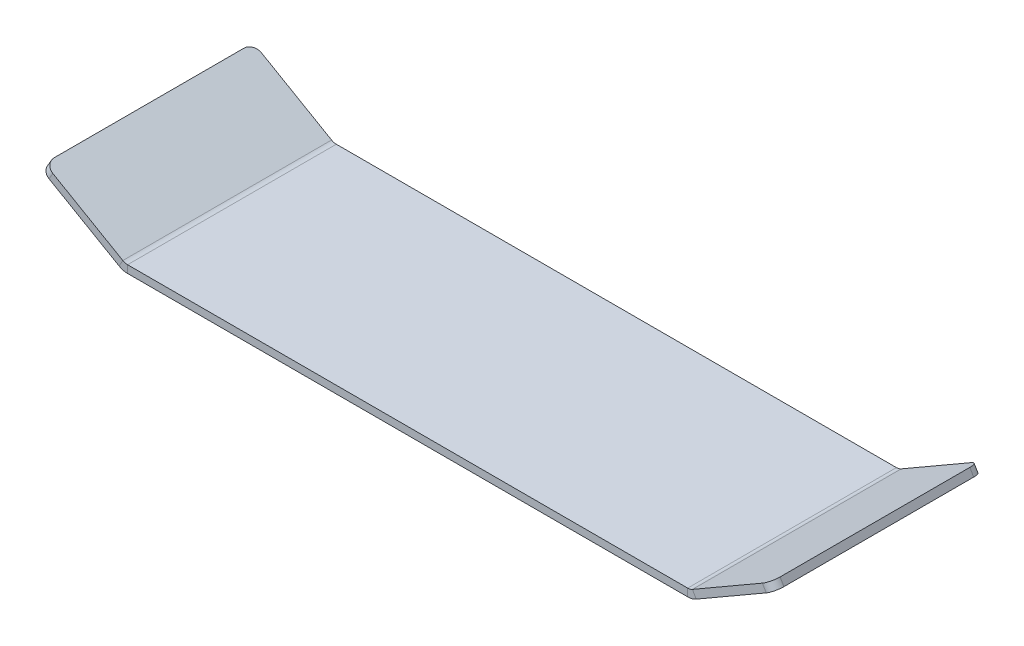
ISO-10303-21;
HEADER;
FILE_DESCRIPTION(('STEP AP214'),'2;1');
FILE_NAME('part.step','',(''),(''),'','','');
FILE_SCHEMA(('AUTOMOTIVE_DESIGN { 1 0 10303 214 1 1 1 1 }'));
ENDSEC;
DATA;
#1=APPLICATION_CONTEXT('core data for automotive mechanical design processes');
#2=APPLICATION_PROTOCOL_DEFINITION('international standard','automotive_design',2000,#1);
#3=PRODUCT_CONTEXT('',#1,'mechanical');
#4=PRODUCT('Part','Part','',(#3));
#5=PRODUCT_RELATED_PRODUCT_CATEGORY('part','',(#4));
#6=PRODUCT_DEFINITION_FORMATION('','',#4);
#7=PRODUCT_DEFINITION_CONTEXT('part definition',#1,'design');
#8=PRODUCT_DEFINITION('design','',#6,#7);
#9=PRODUCT_DEFINITION_SHAPE('','',#8);
#10=(LENGTH_UNIT() NAMED_UNIT(*) SI_UNIT(.MILLI.,.METRE.));
#11=(NAMED_UNIT(*) PLANE_ANGLE_UNIT() SI_UNIT($,.RADIAN.));
#12=(NAMED_UNIT(*) SI_UNIT($,.STERADIAN.) SOLID_ANGLE_UNIT());
#13=UNCERTAINTY_MEASURE_WITH_UNIT(LENGTH_MEASURE(1.E-05),#10,'distance_accuracy_value','');
#14=(GEOMETRIC_REPRESENTATION_CONTEXT(3) GLOBAL_UNCERTAINTY_ASSIGNED_CONTEXT((#13)) GLOBAL_UNIT_ASSIGNED_CONTEXT((#10,
#11,#12)) REPRESENTATION_CONTEXT('',''));
#15=CARTESIAN_POINT('',(0.,0.,0.));
#16=DIRECTION('',(0.,0.,1.));
#17=DIRECTION('',(1.,0.,0.));
#18=AXIS2_PLACEMENT_3D('',#15,#16,#17);
#19=CARTESIAN_POINT('',(4.82308546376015,0.,-220.));
#20=DIRECTION('',(0.,0.,-1.));
#21=DIRECTION('',(-1.,0.,0.));
#22=AXIS2_PLACEMENT_3D('',#19,#20,#21);
#23=PLANE('',#22);
#24=DIRECTION('',(0.,1.,0.));
#25=VECTOR('',#24,1.);
#26=CARTESIAN_POINT('',(4.82308546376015,0.,-220.));
#27=LINE('',#26,#25);
#28=CARTESIAN_POINT('',(4.82308546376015,0.,-220.));
#29=VERTEX_POINT('',#28);
#30=CARTESIAN_POINT('',(4.82308546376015,8.,-220.));
#31=VERTEX_POINT('',#30);
#32=EDGE_CURVE('E266',#29,#31,#27,.T.);
#33=ORIENTED_EDGE('',*,*,#32,.F.);
#34=CARTESIAN_POINT('',(4.82308546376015,18.,-220.));
#35=DIRECTION('',(0.,0.,-1.));
#36=DIRECTION('',(-1.,0.,0.));
#37=AXIS2_PLACEMENT_3D('',#34,#35,#36);
#38=CIRCLE('',#37,18.);
#39=CARTESIAN_POINT('',(-4.17691453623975,2.41154273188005,-220.));
#40=VERTEX_POINT('',#39);
#41=EDGE_CURVE('E217',#40,#29,#38,.F.);
#42=ORIENTED_EDGE('',*,*,#41,.F.);
#43=DIRECTION('',(-0.499999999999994,-0.866025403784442,0.));
#44=VECTOR('',#43,1.);
#45=CARTESIAN_POINT('',(-0.1769145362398,9.33974596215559,-220.));
#46=LINE('',#45,#44);
#47=CARTESIAN_POINT('',(-0.1769145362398,9.33974596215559,-220.));
#48=VERTEX_POINT('',#47);
#49=EDGE_CURVE('E263',#48,#40,#46,.T.);
#50=ORIENTED_EDGE('',*,*,#49,.F.);
#51=CARTESIAN_POINT('',(4.82308546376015,18.,-220.));
#52=DIRECTION('',(0.,0.,1.));
#53=DIRECTION('',(1.,0.,0.));
#54=AXIS2_PLACEMENT_3D('',#51,#52,#53);
#55=CIRCLE('',#54,10.);
#56=EDGE_CURVE('E210',#48,#31,#55,.T.);
#57=ORIENTED_EDGE('',*,*,#56,.T.);
#58=EDGE_LOOP('',(#33,#42,#50,#57));
#59=FACE_BOUND('',#58,.T.);
#60=ADVANCED_FACE('F31',(#59),#23,.T.);
#61=CARTESIAN_POINT('',(-0.1769145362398,9.33974596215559,-220.));
#62=DIRECTION('',(0.,0.,-1.));
#63=DIRECTION('',(-1.,0.,0.));
#64=AXIS2_PLACEMENT_3D('',#61,#62,#63);
#65=PLANE('',#64);
#66=DIRECTION('',(1.,0.,0.));
#67=VECTOR('',#66,1.);
#68=CARTESIAN_POINT('',(0.,0.,-220.));
#69=LINE('',#68,#67);
#70=CARTESIAN_POINT('',(595.17691453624,0.,-220.));
#71=VERTEX_POINT('',#70);
#72=EDGE_CURVE('E220',#29,#71,#69,.T.);
#73=ORIENTED_EDGE('',*,*,#72,.F.);
#74=ORIENTED_EDGE('',*,*,#32,.T.);
#75=DIRECTION('',(1.,0.,0.));
#76=VECTOR('',#75,1.);
#77=CARTESIAN_POINT('',(0.,8.,-220.));
#78=LINE('',#77,#76);
#79=CARTESIAN_POINT('',(595.17691453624,7.99999999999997,-220.));
#80=VERTEX_POINT('',#79);
#81=EDGE_CURVE('E207',#31,#80,#78,.T.);
#82=ORIENTED_EDGE('',*,*,#81,.T.);
#83=DIRECTION('',(0.,-1.,0.));
#84=VECTOR('',#83,1.);
#85=CARTESIAN_POINT('',(595.17691453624,7.99999999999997,-220.));
#86=LINE('',#85,#84);
#87=EDGE_CURVE('E254',#80,#71,#86,.T.);
#88=ORIENTED_EDGE('',*,*,#87,.T.);
#89=EDGE_LOOP('',(#73,#74,#82,#88));
#90=FACE_BOUND('',#89,.T.);
#91=ADVANCED_FACE('F366',(#90),#65,.T.);
#92=CARTESIAN_POINT('',(-4.17691453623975,2.41154273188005,0.));
#93=DIRECTION('',(0.,0.,1.));
#94=DIRECTION('',(1.,0.,0.));
#95=AXIS2_PLACEMENT_3D('',#92,#93,#94);
#96=PLANE('',#95);
#97=DIRECTION('',(0.499999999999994,0.866025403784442,0.));
#98=VECTOR('',#97,1.);
#99=CARTESIAN_POINT('',(-4.17691453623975,2.41154273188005,0.));
#100=LINE('',#99,#98);
#101=CARTESIAN_POINT('',(-4.17691453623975,2.41154273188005,0.));
#102=VERTEX_POINT('',#101);
#103=CARTESIAN_POINT('',(-0.1769145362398,9.33974596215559,0.));
#104=VERTEX_POINT('',#103);
#105=EDGE_CURVE('E260',#102,#104,#100,.T.);
#106=ORIENTED_EDGE('',*,*,#105,.F.);
#107=CARTESIAN_POINT('',(4.82308546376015,18.,0.));
#108=DIRECTION('',(0.,0.,-1.));
#109=DIRECTION('',(-1.,0.,0.));
#110=AXIS2_PLACEMENT_3D('',#107,#108,#109);
#111=CIRCLE('',#110,18.);
#112=CARTESIAN_POINT('',(4.82308546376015,0.,0.));
#113=VERTEX_POINT('',#112);
#114=EDGE_CURVE('E193',#102,#113,#111,.F.);
#115=ORIENTED_EDGE('',*,*,#114,.T.);
#116=DIRECTION('',(0.,-1.,0.));
#117=VECTOR('',#116,1.);
#118=CARTESIAN_POINT('',(4.82308546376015,8.,0.));
#119=LINE('',#118,#117);
#120=CARTESIAN_POINT('',(4.82308546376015,8.,0.));
#121=VERTEX_POINT('',#120);
#122=EDGE_CURVE('E258',#121,#113,#119,.T.);
#123=ORIENTED_EDGE('',*,*,#122,.F.);
#124=CARTESIAN_POINT('',(4.82308546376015,18.,0.));
#125=DIRECTION('',(0.,0.,1.));
#126=DIRECTION('',(1.,0.,0.));
#127=AXIS2_PLACEMENT_3D('',#124,#125,#126);
#128=CIRCLE('',#127,10.);
#129=EDGE_CURVE('E186',#104,#121,#128,.T.);
#130=ORIENTED_EDGE('',*,*,#129,.F.);
#131=EDGE_LOOP('',(#106,#115,#123,#130));
#132=FACE_BOUND('',#131,.T.);
#133=ADVANCED_FACE('F327',(#132),#96,.T.);
#134=CARTESIAN_POINT('',(4.82308546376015,8.,0.));
#135=DIRECTION('',(0.,0.,1.));
#136=DIRECTION('',(1.,0.,0.));
#137=AXIS2_PLACEMENT_3D('',#134,#135,#136);
#138=PLANE('',#137);
#139=DIRECTION('',(0.866025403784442,-0.499999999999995,0.));
#140=VECTOR('',#139,1.);
#141=CARTESIAN_POINT('',(3.99999999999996,6.92820323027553,0.));
#142=LINE('',#141,#140);
#143=CARTESIAN_POINT('',(-73.9422863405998,51.9282032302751,0.));
#144=VERTEX_POINT('',#143);
#145=EDGE_CURVE('E189',#144,#104,#142,.T.);
#146=ORIENTED_EDGE('',*,*,#145,.F.);
#147=DIRECTION('',(0.499999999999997,0.86602540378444,0.));
#148=VECTOR('',#147,1.);
#149=CARTESIAN_POINT('',(-77.9422863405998,44.9999999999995,0.));
#150=LINE('',#149,#148);
#151=CARTESIAN_POINT('',(-77.9422863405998,44.9999999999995,0.));
#152=VERTEX_POINT('',#151);
#153=EDGE_CURVE('E38',#144,#152,#150,.F.);
#154=ORIENTED_EDGE('',*,*,#153,.T.);
#155=DIRECTION('',(0.866025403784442,-0.499999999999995,0.));
#156=VECTOR('',#155,1.);
#157=CARTESIAN_POINT('',(0.,0.,0.));
#158=LINE('',#157,#156);
#159=EDGE_CURVE('E191',#152,#102,#158,.T.);
#160=ORIENTED_EDGE('',*,*,#159,.T.);
#161=ORIENTED_EDGE('',*,*,#105,.T.);
#162=EDGE_LOOP('',(#146,#154,#160,#161));
#163=FACE_BOUND('',#162,.T.);
#164=ADVANCED_FACE('F319',(#163),#138,.T.);
#165=CARTESIAN_POINT('',(604.17691453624,2.41154273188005,-220.));
#166=DIRECTION('',(0.,0.,-1.));
#167=DIRECTION('',(-1.,0.,0.));
#168=AXIS2_PLACEMENT_3D('',#165,#166,#167);
#169=PLANE('',#168);
#170=DIRECTION('',(-0.500000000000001,0.866025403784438,0.));
#171=VECTOR('',#170,1.);
#172=CARTESIAN_POINT('',(604.17691453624,2.41154273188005,-220.));
#173=LINE('',#172,#171);
#174=CARTESIAN_POINT('',(604.17691453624,2.41154273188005,-220.));
#175=VERTEX_POINT('',#174);
#176=CARTESIAN_POINT('',(600.17691453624,9.33974596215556,-220.));
#177=VERTEX_POINT('',#176);
#178=EDGE_CURVE('E256',#175,#177,#173,.T.);
#179=ORIENTED_EDGE('',*,*,#178,.F.);
#180=CARTESIAN_POINT('',(595.17691453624,18.,-220.));
#181=DIRECTION('',(0.,0.,-1.));
#182=DIRECTION('',(-1.,0.,0.));
#183=AXIS2_PLACEMENT_3D('',#180,#181,#182);
#184=CIRCLE('',#183,18.);
#185=EDGE_CURVE('E223',#71,#175,#184,.F.);
#186=ORIENTED_EDGE('',*,*,#185,.F.);
#187=ORIENTED_EDGE('',*,*,#87,.F.);
#188=CARTESIAN_POINT('',(595.17691453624,18.,-220.));
#189=DIRECTION('',(0.,0.,1.));
#190=DIRECTION('',(1.,0.,0.));
#191=AXIS2_PLACEMENT_3D('',#188,#189,#190);
#192=CIRCLE('',#191,10.);
#193=EDGE_CURVE('E204',#80,#177,#192,.T.);
#194=ORIENTED_EDGE('',*,*,#193,.T.);
#195=EDGE_LOOP('',(#179,#186,#187,#194));
#196=FACE_BOUND('',#195,.T.);
#197=ADVANCED_FACE('F363',(#196),#169,.T.);
#198=CARTESIAN_POINT('',(595.17691453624,7.99999999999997,-220.));
#199=DIRECTION('',(0.,0.,-1.));
#200=DIRECTION('',(-1.,0.,0.));
#201=AXIS2_PLACEMENT_3D('',#198,#199,#200);
#202=PLANE('',#201);
#203=DIRECTION('',(0.866025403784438,0.5,0.));
#204=VECTOR('',#203,1.);
#205=CARTESIAN_POINT('',(596.,6.92820323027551,-220.));
#206=LINE('',#205,#204);
#207=CARTESIAN_POINT('',(673.942286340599,51.9282032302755,-220.));
#208=VERTEX_POINT('',#207);
#209=EDGE_CURVE('E175',#177,#208,#206,.T.);
#210=ORIENTED_EDGE('',*,*,#209,.T.);
#211=DIRECTION('',(0.5,-0.866025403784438,0.));
#212=VECTOR('',#211,1.);
#213=CARTESIAN_POINT('',(677.942286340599,45.,-220.));
#214=LINE('',#213,#212);
#215=CARTESIAN_POINT('',(677.942286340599,45.,-220.));
#216=VERTEX_POINT('',#215);
#217=EDGE_CURVE('E268',#208,#216,#214,.T.);
#218=ORIENTED_EDGE('',*,*,#217,.T.);
#219=DIRECTION('',(0.866025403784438,0.5,0.));
#220=VECTOR('',#219,1.);
#221=CARTESIAN_POINT('',(600.,0.,-220.));
#222=LINE('',#221,#220);
#223=EDGE_CURVE('E200',#175,#216,#222,.T.);
#224=ORIENTED_EDGE('',*,*,#223,.F.);
#225=ORIENTED_EDGE('',*,*,#178,.T.);
#226=EDGE_LOOP('',(#210,#218,#224,#225));
#227=FACE_BOUND('',#226,.T.);
#228=ADVANCED_FACE('F361',(#227),#202,.T.);
#229=CARTESIAN_POINT('',(595.17691453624,0.,0.));
#230=DIRECTION('',(0.,0.,1.));
#231=DIRECTION('',(1.,0.,0.));
#232=AXIS2_PLACEMENT_3D('',#229,#230,#231);
#233=PLANE('',#232);
#234=DIRECTION('',(0.,1.,0.));
#235=VECTOR('',#234,1.);
#236=CARTESIAN_POINT('',(595.17691453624,0.,0.));
#237=LINE('',#236,#235);
#238=CARTESIAN_POINT('',(595.17691453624,0.,0.));
#239=VERTEX_POINT('',#238);
#240=CARTESIAN_POINT('',(595.17691453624,7.99999999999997,0.));
#241=VERTEX_POINT('',#240);
#242=EDGE_CURVE('E153',#239,#241,#237,.T.);
#243=ORIENTED_EDGE('',*,*,#242,.F.);
#244=CARTESIAN_POINT('',(595.17691453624,18.,0.));
#245=DIRECTION('',(0.,0.,-1.));
#246=DIRECTION('',(-1.,0.,0.));
#247=AXIS2_PLACEMENT_3D('',#244,#245,#246);
#248=CIRCLE('',#247,18.);
#249=CARTESIAN_POINT('',(604.17691453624,2.41154273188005,0.));
#250=VERTEX_POINT('',#249);
#251=EDGE_CURVE('E148',#239,#250,#248,.F.);
#252=ORIENTED_EDGE('',*,*,#251,.T.);
#253=DIRECTION('',(0.500000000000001,-0.866025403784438,0.));
#254=VECTOR('',#253,1.);
#255=CARTESIAN_POINT('',(600.17691453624,9.33974596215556,0.));
#256=LINE('',#255,#254);
#257=CARTESIAN_POINT('',(600.17691453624,9.33974596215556,0.));
#258=VERTEX_POINT('',#257);
#259=EDGE_CURVE('E143',#258,#250,#256,.T.);
#260=ORIENTED_EDGE('',*,*,#259,.F.);
#261=CARTESIAN_POINT('',(595.17691453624,18.,0.));
#262=DIRECTION('',(0.,0.,1.));
#263=DIRECTION('',(1.,0.,0.));
#264=AXIS2_PLACEMENT_3D('',#261,#262,#263);
#265=CIRCLE('',#264,10.);
#266=EDGE_CURVE('E146',#241,#258,#265,.T.);
#267=ORIENTED_EDGE('',*,*,#266,.F.);
#268=EDGE_LOOP('',(#243,#252,#260,#267));
#269=FACE_BOUND('',#268,.T.);
#270=ADVANCED_FACE('F145',(#269),#233,.T.);
#271=CARTESIAN_POINT('',(600.17691453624,9.33974596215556,0.));
#272=DIRECTION('',(0.,0.,1.));
#273=DIRECTION('',(1.,0.,0.));
#274=AXIS2_PLACEMENT_3D('',#271,#272,#273);
#275=PLANE('',#274);
#276=DIRECTION('',(1.,0.,0.));
#277=VECTOR('',#276,1.);
#278=CARTESIAN_POINT('',(0.,0.,0.));
#279=LINE('',#278,#277);
#280=EDGE_CURVE('E196',#113,#239,#279,.T.);
#281=ORIENTED_EDGE('',*,*,#280,.T.);
#282=ORIENTED_EDGE('',*,*,#242,.T.);
#283=DIRECTION('',(1.,0.,0.));
#284=VECTOR('',#283,1.);
#285=CARTESIAN_POINT('',(0.,8.,0.));
#286=LINE('',#285,#284);
#287=EDGE_CURVE('E166',#121,#241,#286,.T.);
#288=ORIENTED_EDGE('',*,*,#287,.F.);
#289=ORIENTED_EDGE('',*,*,#122,.T.);
#290=EDGE_LOOP('',(#281,#282,#288,#289));
#291=FACE_BOUND('',#290,.T.);
#292=ADVANCED_FACE('F331',(#291),#275,.T.);
#293=CARTESIAN_POINT('',(600.,0.,-220.));
#294=DIRECTION('',(0.5,-0.866025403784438,0.));
#295=DIRECTION('',(0.866025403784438,0.5,0.));
#296=AXIS2_PLACEMENT_3D('',#293,#294,#295);
#297=PLANE('',#296);
#298=ORIENTED_EDGE('',*,*,#223,.T.);
#299=CARTESIAN_POINT('',(677.942286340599,45.,-210.));
#300=DIRECTION('',(0.5,-0.866025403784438,0.));
#301=DIRECTION('',(0.866025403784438,0.5,0.));
#302=AXIS2_PLACEMENT_3D('',#299,#300,#301);
#303=CIRCLE('',#302,10.);
#304=CARTESIAN_POINT('',(686.602540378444,50.,-210.));
#305=VERTEX_POINT('',#304);
#306=EDGE_CURVE('E273',#216,#305,#303,.T.);
#307=ORIENTED_EDGE('',*,*,#306,.T.);
#308=DIRECTION('',(0.,0.,1.));
#309=VECTOR('',#308,1.);
#310=CARTESIAN_POINT('',(686.602540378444,50.,-220.));
#311=LINE('',#310,#309);
#312=CARTESIAN_POINT('',(686.602540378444,50.,-10.));
#313=VERTEX_POINT('',#312);
#314=EDGE_CURVE('E226',#305,#313,#311,.T.);
#315=ORIENTED_EDGE('',*,*,#314,.T.);
#316=CARTESIAN_POINT('',(677.942286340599,45.,-10.));
#317=DIRECTION('',(0.5,-0.866025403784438,0.));
#318=DIRECTION('',(0.866025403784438,0.5,0.));
#319=AXIS2_PLACEMENT_3D('',#316,#317,#318);
#320=CIRCLE('',#319,10.);
#321=CARTESIAN_POINT('',(677.942286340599,45.,0.));
#322=VERTEX_POINT('',#321);
#323=EDGE_CURVE('E271',#313,#322,#320,.T.);
#324=ORIENTED_EDGE('',*,*,#323,.T.);
#325=DIRECTION('',(0.866025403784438,0.5,0.));
#326=VECTOR('',#325,1.);
#327=CARTESIAN_POINT('',(600.,0.,0.));
#328=LINE('',#327,#326);
#329=EDGE_CURVE('E180',#250,#322,#328,.T.);
#330=ORIENTED_EDGE('',*,*,#329,.F.);
#331=DIRECTION('',(0.,0.,1.));
#332=VECTOR('',#331,1.);
#333=CARTESIAN_POINT('',(604.17691453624,2.41154273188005,-220.));
#334=LINE('',#333,#332);
#335=EDGE_CURVE('E154',#175,#250,#334,.T.);
#336=ORIENTED_EDGE('',*,*,#335,.F.);
#337=EDGE_LOOP('',(#298,#307,#315,#324,#330,#336));
#338=FACE_BOUND('',#337,.T.);
#339=ADVANCED_FACE('F348',(#338),#297,.T.);
#340=CARTESIAN_POINT('',(595.17691453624,18.,-220.));
#341=DIRECTION('',(0.,0.,1.));
#342=DIRECTION('',(1.,0.,0.));
#343=AXIS2_PLACEMENT_3D('',#340,#341,#342);
#344=CYLINDRICAL_SURFACE('',#343,18.);
#345=ORIENTED_EDGE('',*,*,#251,.F.);
#346=DIRECTION('',(0.,0.,1.));
#347=VECTOR('',#346,1.);
#348=CARTESIAN_POINT('',(595.17691453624,0.,-220.));
#349=LINE('',#348,#347);
#350=EDGE_CURVE('E228',#71,#239,#349,.T.);
#351=ORIENTED_EDGE('',*,*,#350,.F.);
#352=ORIENTED_EDGE('',*,*,#185,.T.);
#353=ORIENTED_EDGE('',*,*,#335,.T.);
#354=EDGE_LOOP('',(#345,#351,#352,#353));
#355=FACE_BOUND('',#354,.T.);
#356=ADVANCED_FACE('F343',(#355),#344,.T.);
#357=CARTESIAN_POINT('',(0.,0.,-220.));
#358=DIRECTION('',(0.,-1.,0.));
#359=DIRECTION('',(0.,0.,-1.));
#360=AXIS2_PLACEMENT_3D('',#357,#358,#359);
#361=PLANE('',#360);
#362=ORIENTED_EDGE('',*,*,#280,.F.);
#363=DIRECTION('',(0.,0.,1.));
#364=VECTOR('',#363,1.);
#365=CARTESIAN_POINT('',(4.82308546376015,0.,-220.));
#366=LINE('',#365,#364);
#367=EDGE_CURVE('E231',#29,#113,#366,.T.);
#368=ORIENTED_EDGE('',*,*,#367,.F.);
#369=ORIENTED_EDGE('',*,*,#72,.T.);
#370=ORIENTED_EDGE('',*,*,#350,.T.);
#371=EDGE_LOOP('',(#362,#368,#369,#370));
#372=FACE_BOUND('',#371,.T.);
#373=ADVANCED_FACE('F339',(#372),#361,.T.);
#374=CARTESIAN_POINT('',(4.82308546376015,18.,-220.));
#375=DIRECTION('',(0.,0.,1.));
#376=DIRECTION('',(1.,0.,0.));
#377=AXIS2_PLACEMENT_3D('',#374,#375,#376);
#378=CYLINDRICAL_SURFACE('',#377,18.);
#379=ORIENTED_EDGE('',*,*,#114,.F.);
#380=DIRECTION('',(0.,0.,1.));
#381=VECTOR('',#380,1.);
#382=CARTESIAN_POINT('',(-4.17691453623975,2.41154273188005,-220.));
#383=LINE('',#382,#381);
#384=EDGE_CURVE('E234',#40,#102,#383,.T.);
#385=ORIENTED_EDGE('',*,*,#384,.F.);
#386=ORIENTED_EDGE('',*,*,#41,.T.);
#387=ORIENTED_EDGE('',*,*,#367,.T.);
#388=EDGE_LOOP('',(#379,#385,#386,#387));
#389=FACE_BOUND('',#388,.T.);
#390=ADVANCED_FACE('F335',(#389),#378,.T.);
#391=CARTESIAN_POINT('',(0.,0.,-220.));
#392=DIRECTION('',(-0.499999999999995,-0.866025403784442,0.));
#393=DIRECTION('',(0.866025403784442,-0.499999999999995,0.));
#394=AXIS2_PLACEMENT_3D('',#391,#392,#393);
#395=PLANE('',#394);
#396=DIRECTION('',(0.,0.,1.));
#397=VECTOR('',#396,1.);
#398=CARTESIAN_POINT('',(-86.6025403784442,49.9999999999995,-220.));
#399=LINE('',#398,#397);
#400=CARTESIAN_POINT('',(-86.6025403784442,49.9999999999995,-210.));
#401=VERTEX_POINT('',#400);
#402=CARTESIAN_POINT('',(-86.6025403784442,49.9999999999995,-10.));
#403=VERTEX_POINT('',#402);
#404=EDGE_CURVE('E237',#401,#403,#399,.T.);
#405=ORIENTED_EDGE('',*,*,#404,.F.);
#406=CARTESIAN_POINT('',(-77.9422863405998,44.9999999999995,-210.));
#407=DIRECTION('',(-0.499999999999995,-0.866025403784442,0.));
#408=DIRECTION('',(0.866025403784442,-0.499999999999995,0.));
#409=AXIS2_PLACEMENT_3D('',#406,#407,#408);
#410=CIRCLE('',#409,10.);
#411=CARTESIAN_POINT('',(-77.9422863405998,44.9999999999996,-220.));
#412=VERTEX_POINT('',#411);
#413=EDGE_CURVE('E297',#401,#412,#410,.T.);
#414=ORIENTED_EDGE('',*,*,#413,.T.);
#415=DIRECTION('',(0.866025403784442,-0.499999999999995,0.));
#416=VECTOR('',#415,1.);
#417=CARTESIAN_POINT('',(0.,0.,-220.));
#418=LINE('',#417,#416);
#419=EDGE_CURVE('E215',#412,#40,#418,.T.);
#420=ORIENTED_EDGE('',*,*,#419,.T.);
#421=ORIENTED_EDGE('',*,*,#384,.T.);
#422=ORIENTED_EDGE('',*,*,#159,.F.);
#423=CARTESIAN_POINT('',(-77.9422863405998,44.9999999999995,-10.));
#424=DIRECTION('',(-0.499999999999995,-0.866025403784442,0.));
#425=DIRECTION('',(0.866025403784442,-0.499999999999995,0.));
#426=AXIS2_PLACEMENT_3D('',#423,#424,#425);
#427=CIRCLE('',#426,10.);
#428=EDGE_CURVE('E51',#152,#403,#427,.T.);
#429=ORIENTED_EDGE('',*,*,#428,.T.);
#430=EDGE_LOOP('',(#405,#414,#420,#421,#422,#429));
#431=FACE_BOUND('',#430,.T.);
#432=ADVANCED_FACE('F300',(#431),#395,.T.);
#433=CARTESIAN_POINT('',(-86.6025403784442,49.9999999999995,-220.));
#434=DIRECTION('',(0.86602540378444,-0.499999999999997,0.));
#435=DIRECTION('',(0.499999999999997,0.86602540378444,0.));
#436=AXIS2_PLACEMENT_3D('',#433,#434,#435);
#437=PLANE('',#436);
#438=DIRECTION('',(0.,0.,1.));
#439=VECTOR('',#438,1.);
#440=CARTESIAN_POINT('',(-82.6025403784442,56.928203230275,-220.));
#441=LINE('',#440,#439);
#442=CARTESIAN_POINT('',(-82.6025403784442,56.928203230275,-210.));
#443=VERTEX_POINT('',#442);
#444=CARTESIAN_POINT('',(-82.6025403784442,56.928203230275,-10.));
#445=VERTEX_POINT('',#444);
#446=EDGE_CURVE('E239',#443,#445,#441,.T.);
#447=ORIENTED_EDGE('',*,*,#446,.F.);
#448=DIRECTION('',(0.499999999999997,0.86602540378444,0.));
#449=VECTOR('',#448,1.);
#450=CARTESIAN_POINT('',(-86.6025403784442,49.9999999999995,-210.));
#451=LINE('',#450,#449);
#452=EDGE_CURVE('E294',#443,#401,#451,.F.);
#453=ORIENTED_EDGE('',*,*,#452,.T.);
#454=ORIENTED_EDGE('',*,*,#404,.T.);
#455=DIRECTION('',(0.499999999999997,0.86602540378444,0.));
#456=VECTOR('',#455,1.);
#457=CARTESIAN_POINT('',(-82.6025403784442,56.928203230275,-10.));
#458=LINE('',#457,#456);
#459=EDGE_CURVE('E291',#403,#445,#458,.T.);
#460=ORIENTED_EDGE('',*,*,#459,.T.);
#461=EDGE_LOOP('',(#447,#453,#454,#460));
#462=FACE_BOUND('',#461,.T.);
#463=ADVANCED_FACE('F315',(#462),#437,.F.);
#464=CARTESIAN_POINT('',(3.99999999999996,6.92820323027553,-220.));
#465=DIRECTION('',(-0.499999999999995,-0.866025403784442,0.));
#466=DIRECTION('',(0.866025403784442,-0.499999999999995,0.));
#467=AXIS2_PLACEMENT_3D('',#464,#465,#466);
#468=PLANE('',#467);
#469=DIRECTION('',(0.866025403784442,-0.499999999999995,0.));
#470=VECTOR('',#469,1.);
#471=CARTESIAN_POINT('',(3.99999999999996,6.92820323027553,-220.));
#472=LINE('',#471,#470);
#473=CARTESIAN_POINT('',(-73.9422863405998,51.9282032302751,-220.));
#474=VERTEX_POINT('',#473);
#475=EDGE_CURVE('E213',#474,#48,#472,.T.);
#476=ORIENTED_EDGE('',*,*,#475,.F.);
#477=CARTESIAN_POINT('',(-73.9422863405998,51.9282032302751,-210.));
#478=DIRECTION('',(-0.499999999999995,-0.866025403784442,0.));
#479=DIRECTION('',(0.866025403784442,-0.499999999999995,0.));
#480=AXIS2_PLACEMENT_3D('',#477,#478,#479);
#481=CIRCLE('',#480,10.);
#482=EDGE_CURVE('E289',#474,#443,#481,.F.);
#483=ORIENTED_EDGE('',*,*,#482,.T.);
#484=ORIENTED_EDGE('',*,*,#446,.T.);
#485=CARTESIAN_POINT('',(-73.9422863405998,51.9282032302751,-10.));
#486=DIRECTION('',(-0.499999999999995,-0.866025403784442,0.));
#487=DIRECTION('',(0.866025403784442,-0.499999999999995,0.));
#488=AXIS2_PLACEMENT_3D('',#485,#486,#487);
#489=CIRCLE('',#488,10.);
#490=EDGE_CURVE('E287',#445,#144,#489,.F.);
#491=ORIENTED_EDGE('',*,*,#490,.T.);
#492=ORIENTED_EDGE('',*,*,#145,.T.);
#493=DIRECTION('',(0.,0.,1.));
#494=VECTOR('',#493,1.);
#495=CARTESIAN_POINT('',(-0.1769145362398,9.33974596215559,-220.));
#496=LINE('',#495,#494);
#497=EDGE_CURVE('E242',#48,#104,#496,.T.);
#498=ORIENTED_EDGE('',*,*,#497,.F.);
#499=EDGE_LOOP('',(#476,#483,#484,#491,#492,#498));
#500=FACE_BOUND('',#499,.T.);
#501=ADVANCED_FACE('F312',(#500),#468,.F.);
#502=CARTESIAN_POINT('',(4.82308546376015,18.,-220.));
#503=DIRECTION('',(0.,0.,1.));
#504=DIRECTION('',(1.,0.,0.));
#505=AXIS2_PLACEMENT_3D('',#502,#503,#504);
#506=CYLINDRICAL_SURFACE('',#505,10.);
#507=ORIENTED_EDGE('',*,*,#129,.T.);
#508=DIRECTION('',(0.,0.,1.));
#509=VECTOR('',#508,1.);
#510=CARTESIAN_POINT('',(4.82308546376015,8.,-220.));
#511=LINE('',#510,#509);
#512=EDGE_CURVE('E245',#31,#121,#511,.T.);
#513=ORIENTED_EDGE('',*,*,#512,.F.);
#514=ORIENTED_EDGE('',*,*,#56,.F.);
#515=ORIENTED_EDGE('',*,*,#497,.T.);
#516=EDGE_LOOP('',(#507,#513,#514,#515));
#517=FACE_BOUND('',#516,.T.);
#518=ADVANCED_FACE('F325',(#517),#506,.F.);
#519=CARTESIAN_POINT('',(0.,8.,-220.));
#520=DIRECTION('',(0.,-1.,0.));
#521=DIRECTION('',(0.,0.,-1.));
#522=AXIS2_PLACEMENT_3D('',#519,#520,#521);
#523=PLANE('',#522);
#524=ORIENTED_EDGE('',*,*,#287,.T.);
#525=DIRECTION('',(0.,0.,1.));
#526=VECTOR('',#525,1.);
#527=CARTESIAN_POINT('',(595.17691453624,7.99999999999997,-220.));
#528=LINE('',#527,#526);
#529=EDGE_CURVE('E165',#80,#241,#528,.T.);
#530=ORIENTED_EDGE('',*,*,#529,.F.);
#531=ORIENTED_EDGE('',*,*,#81,.F.);
#532=ORIENTED_EDGE('',*,*,#512,.T.);
#533=EDGE_LOOP('',(#524,#530,#531,#532));
#534=FACE_BOUND('',#533,.T.);
#535=ADVANCED_FACE('F368',(#534),#523,.F.);
#536=CARTESIAN_POINT('',(595.17691453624,18.,-220.));
#537=DIRECTION('',(0.,0.,1.));
#538=DIRECTION('',(1.,0.,0.));
#539=AXIS2_PLACEMENT_3D('',#536,#537,#538);
#540=CYLINDRICAL_SURFACE('',#539,10.);
#541=ORIENTED_EDGE('',*,*,#266,.T.);
#542=DIRECTION('',(0.,0.,1.));
#543=VECTOR('',#542,1.);
#544=CARTESIAN_POINT('',(600.17691453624,9.33974596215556,-220.));
#545=LINE('',#544,#543);
#546=EDGE_CURVE('E162',#177,#258,#545,.T.);
#547=ORIENTED_EDGE('',*,*,#546,.F.);
#548=ORIENTED_EDGE('',*,*,#193,.F.);
#549=ORIENTED_EDGE('',*,*,#529,.T.);
#550=EDGE_LOOP('',(#541,#547,#548,#549));
#551=FACE_BOUND('',#550,.T.);
#552=ADVANCED_FACE('F160',(#551),#540,.F.);
#553=CARTESIAN_POINT('',(596.,6.92820323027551,-220.));
#554=DIRECTION('',(0.5,-0.866025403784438,0.));
#555=DIRECTION('',(0.866025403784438,0.5,0.));
#556=AXIS2_PLACEMENT_3D('',#553,#554,#555);
#557=PLANE('',#556);
#558=DIRECTION('',(0.,0.,1.));
#559=VECTOR('',#558,1.);
#560=CARTESIAN_POINT('',(682.602540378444,56.9282032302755,-220.));
#561=LINE('',#560,#559);
#562=CARTESIAN_POINT('',(682.602540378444,56.9282032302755,-210.));
#563=VERTEX_POINT('',#562);
#564=CARTESIAN_POINT('',(682.602540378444,56.9282032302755,-10.));
#565=VERTEX_POINT('',#564);
#566=EDGE_CURVE('E176',#563,#565,#561,.T.);
#567=ORIENTED_EDGE('',*,*,#566,.F.);
#568=CARTESIAN_POINT('',(673.942286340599,51.9282032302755,-210.));
#569=DIRECTION('',(0.5,-0.866025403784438,0.));
#570=DIRECTION('',(0.866025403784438,0.5,0.));
#571=AXIS2_PLACEMENT_3D('',#568,#569,#570);
#572=CIRCLE('',#571,10.);
#573=EDGE_CURVE('E282',#563,#208,#572,.F.);
#574=ORIENTED_EDGE('',*,*,#573,.T.);
#575=ORIENTED_EDGE('',*,*,#209,.F.);
#576=ORIENTED_EDGE('',*,*,#546,.T.);
#577=DIRECTION('',(0.866025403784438,0.5,0.));
#578=VECTOR('',#577,1.);
#579=CARTESIAN_POINT('',(596.,6.92820323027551,0.));
#580=LINE('',#579,#578);
#581=CARTESIAN_POINT('',(673.942286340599,51.9282032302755,0.));
#582=VERTEX_POINT('',#581);
#583=EDGE_CURVE('E167',#258,#582,#580,.T.);
#584=ORIENTED_EDGE('',*,*,#583,.T.);
#585=CARTESIAN_POINT('',(673.942286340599,51.9282032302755,-10.));
#586=DIRECTION('',(0.5,-0.866025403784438,0.));
#587=DIRECTION('',(0.866025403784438,0.5,0.));
#588=AXIS2_PLACEMENT_3D('',#585,#586,#587);
#589=CIRCLE('',#588,10.);
#590=EDGE_CURVE('E280',#582,#565,#589,.F.);
#591=ORIENTED_EDGE('',*,*,#590,.T.);
#592=EDGE_LOOP('',(#567,#574,#575,#576,#584,#591));
#593=FACE_BOUND('',#592,.T.);
#594=ADVANCED_FACE('F172',(#593),#557,.F.);
#595=CARTESIAN_POINT('',(682.602540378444,56.9282032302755,-220.));
#596=DIRECTION('',(-0.866025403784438,-0.5,0.));
#597=DIRECTION('',(0.5,-0.866025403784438,0.));
#598=AXIS2_PLACEMENT_3D('',#595,#596,#597);
#599=PLANE('',#598);
#600=ORIENTED_EDGE('',*,*,#314,.F.);
#601=DIRECTION('',(0.5,-0.866025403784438,0.));
#602=VECTOR('',#601,1.);
#603=CARTESIAN_POINT('',(682.602540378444,56.9282032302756,-210.));
#604=LINE('',#603,#602);
#605=EDGE_CURVE('E278',#305,#563,#604,.F.);
#606=ORIENTED_EDGE('',*,*,#605,.T.);
#607=ORIENTED_EDGE('',*,*,#566,.T.);
#608=DIRECTION('',(0.5,-0.866025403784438,0.));
#609=VECTOR('',#608,1.);
#610=CARTESIAN_POINT('',(686.602540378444,50.,-10.));
#611=LINE('',#610,#609);
#612=EDGE_CURVE('E275',#565,#313,#611,.T.);
#613=ORIENTED_EDGE('',*,*,#612,.T.);
#614=EDGE_LOOP('',(#600,#606,#607,#613));
#615=FACE_BOUND('',#614,.T.);
#616=ADVANCED_FACE('F355',(#615),#599,.F.);
#617=CARTESIAN_POINT('',(595.17691453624,18.,-220.));
#618=DIRECTION('',(0.,0.,1.));
#619=DIRECTION('',(1.,0.,0.));
#620=AXIS2_PLACEMENT_3D('',#617,#618,#619);
#621=PLANE('',#620);
#622=ORIENTED_EDGE('',*,*,#419,.F.);
#623=DIRECTION('',(0.499999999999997,0.86602540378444,0.));
#624=VECTOR('',#623,1.);
#625=CARTESIAN_POINT('',(78.6461709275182,316.21916386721,-220.));
#626=LINE('',#625,#624);
#627=EDGE_CURVE('E284',#412,#474,#626,.T.);
#628=ORIENTED_EDGE('',*,*,#627,.T.);
#629=ORIENTED_EDGE('',*,*,#475,.T.);
#630=ORIENTED_EDGE('',*,*,#49,.T.);
#631=EDGE_LOOP('',(#622,#628,#629,#630));
#632=FACE_BOUND('',#631,.T.);
#633=ADVANCED_FACE('F305',(#632),#621,.F.);
#634=CARTESIAN_POINT('',(595.17691453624,18.,0.));
#635=DIRECTION('',(0.,0.,1.));
#636=DIRECTION('',(1.,0.,0.));
#637=AXIS2_PLACEMENT_3D('',#634,#635,#636);
#638=PLANE('',#637);
#639=ORIENTED_EDGE('',*,*,#329,.T.);
#640=DIRECTION('',(0.5,-0.866025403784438,0.));
#641=VECTOR('',#640,1.);
#642=CARTESIAN_POINT('',(673.942286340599,51.9282032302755,0.));
#643=LINE('',#642,#641);
#644=EDGE_CURVE('E11',#322,#582,#643,.F.);
#645=ORIENTED_EDGE('',*,*,#644,.T.);
#646=ORIENTED_EDGE('',*,*,#583,.F.);
#647=ORIENTED_EDGE('',*,*,#259,.T.);
#648=EDGE_LOOP('',(#639,#645,#646,#647));
#649=FACE_BOUND('',#648,.T.);
#650=ADVANCED_FACE('F178',(#649),#638,.T.);
#651=CARTESIAN_POINT('',(673.272413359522,53.0884572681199,-210.));
#652=DIRECTION('',(-0.5,0.866025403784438,0.));
#653=DIRECTION('',(-0.866025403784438,-0.5,0.));
#654=AXIS2_PLACEMENT_3D('',#651,#652,#653);
#655=CYLINDRICAL_SURFACE('',#654,10.);
#656=ORIENTED_EDGE('',*,*,#573,.F.);
#657=ORIENTED_EDGE('',*,*,#605,.F.);
#658=ORIENTED_EDGE('',*,*,#306,.F.);
#659=ORIENTED_EDGE('',*,*,#217,.F.);
#660=EDGE_LOOP('',(#656,#657,#658,#659));
#661=FACE_BOUND('',#660,.T.);
#662=ADVANCED_FACE('F358',(#661),#655,.T.);
#663=CARTESIAN_POINT('',(78.6461709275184,316.21916386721,-210.));
#664=DIRECTION('',(0.499999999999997,0.86602540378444,0.));
#665=DIRECTION('',(-0.86602540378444,0.499999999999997,0.));
#666=AXIS2_PLACEMENT_3D('',#663,#664,#665);
#667=CYLINDRICAL_SURFACE('',#666,10.);
#668=ORIENTED_EDGE('',*,*,#413,.F.);
#669=ORIENTED_EDGE('',*,*,#452,.F.);
#670=ORIENTED_EDGE('',*,*,#482,.F.);
#671=ORIENTED_EDGE('',*,*,#627,.F.);
#672=EDGE_LOOP('',(#668,#669,#670,#671));
#673=FACE_BOUND('',#672,.T.);
#674=ADVANCED_FACE('F309',(#673),#667,.T.);
#675=CARTESIAN_POINT('',(-77.9422863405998,44.9999999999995,-10.));
#676=DIRECTION('',(-0.499999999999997,-0.86602540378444,0.));
#677=DIRECTION('',(0.86602540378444,-0.499999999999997,0.));
#678=AXIS2_PLACEMENT_3D('',#675,#676,#677);
#679=CYLINDRICAL_SURFACE('',#678,10.);
#680=ORIENTED_EDGE('',*,*,#428,.F.);
#681=ORIENTED_EDGE('',*,*,#153,.F.);
#682=ORIENTED_EDGE('',*,*,#490,.F.);
#683=ORIENTED_EDGE('',*,*,#459,.F.);
#684=EDGE_LOOP('',(#680,#681,#682,#683));
#685=FACE_BOUND('',#684,.T.);
#686=ADVANCED_FACE('F318',(#685),#679,.T.);
#687=CARTESIAN_POINT('',(673.942286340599,51.9282032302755,-10.));
#688=DIRECTION('',(-0.5,0.866025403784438,0.));
#689=DIRECTION('',(-0.866025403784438,-0.5,0.));
#690=AXIS2_PLACEMENT_3D('',#687,#688,#689);
#691=CYLINDRICAL_SURFACE('',#690,10.);
#692=ORIENTED_EDGE('',*,*,#590,.F.);
#693=ORIENTED_EDGE('',*,*,#644,.F.);
#694=ORIENTED_EDGE('',*,*,#323,.F.);
#695=ORIENTED_EDGE('',*,*,#612,.F.);
#696=EDGE_LOOP('',(#692,#693,#694,#695));
#697=FACE_BOUND('',#696,.T.);
#698=ADVANCED_FACE('F350',(#697),#691,.T.);
#699=CLOSED_SHELL('',(#60,#91,#133,#164,#197,#228,#270,#292,#339,#356,#373,#390,#432,#463,#501,
#518,#535,#552,#594,#616,#633,#650,#662,#674,#686,#698));
#700=MANIFOLD_SOLID_BREP('B2',#699);
#701=ADVANCED_BREP_SHAPE_REPRESENTATION('',(#18,#700),#14);
#702=SHAPE_DEFINITION_REPRESENTATION(#9,#701);
ENDSEC;
END-ISO-10303-21;
